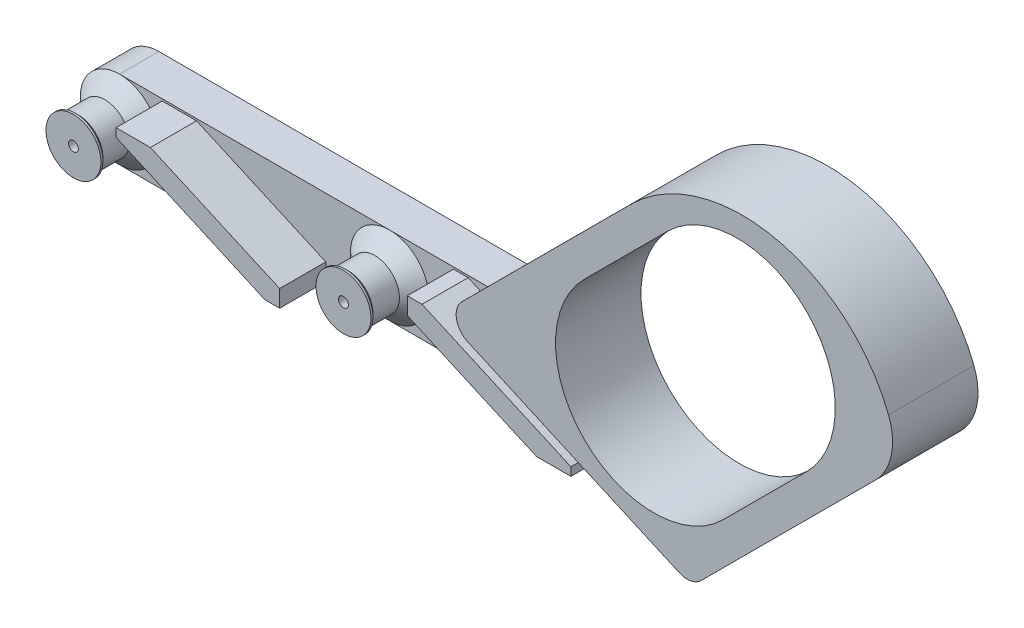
ISO-10303-21;
HEADER;
FILE_DESCRIPTION(('STEP AP214'),'2;1');
FILE_NAME('part.step','',(''),(''),'','','');
FILE_SCHEMA(('AUTOMOTIVE_DESIGN { 1 0 10303 214 1 1 1 1 }'));
ENDSEC;
DATA;
#1=APPLICATION_CONTEXT('core data for automotive mechanical design processes');
#2=APPLICATION_PROTOCOL_DEFINITION('international standard','automotive_design',2000,#1);
#3=PRODUCT_CONTEXT('',#1,'mechanical');
#4=PRODUCT('Part','Part','',(#3));
#5=PRODUCT_RELATED_PRODUCT_CATEGORY('part','',(#4));
#6=PRODUCT_DEFINITION_FORMATION('','',#4);
#7=PRODUCT_DEFINITION_CONTEXT('part definition',#1,'design');
#8=PRODUCT_DEFINITION('design','',#6,#7);
#9=PRODUCT_DEFINITION_SHAPE('','',#8);
#10=(LENGTH_UNIT() NAMED_UNIT(*) SI_UNIT(.MILLI.,.METRE.));
#11=(NAMED_UNIT(*) PLANE_ANGLE_UNIT() SI_UNIT($,.RADIAN.));
#12=(NAMED_UNIT(*) SI_UNIT($,.STERADIAN.) SOLID_ANGLE_UNIT());
#13=UNCERTAINTY_MEASURE_WITH_UNIT(LENGTH_MEASURE(1.E-05),#10,'distance_accuracy_value','');
#14=(GEOMETRIC_REPRESENTATION_CONTEXT(3) GLOBAL_UNCERTAINTY_ASSIGNED_CONTEXT((#13)) GLOBAL_UNIT_ASSIGNED_CONTEXT((#10,
#11,#12)) REPRESENTATION_CONTEXT('',''));
#15=CARTESIAN_POINT('',(0.,0.,0.));
#16=DIRECTION('',(0.,0.,1.));
#17=DIRECTION('',(1.,0.,0.));
#18=AXIS2_PLACEMENT_3D('',#15,#16,#17);
#19=CARTESIAN_POINT('',(27.5,0.,4.));
#20=DIRECTION('',(0.,0.,-1.));
#21=DIRECTION('',(-1.,0.,0.));
#22=AXIS2_PLACEMENT_3D('',#19,#20,#21);
#23=CYLINDRICAL_SURFACE('',#22,4.00000000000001);
#24=DIRECTION('',(0.,0.,-1.));
#25=VECTOR('',#24,1.);
#26=CARTESIAN_POINT('',(27.9133310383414,-3.97858736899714,4.));
#27=LINE('',#26,#25);
#28=CARTESIAN_POINT('',(27.9133310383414,-3.97858736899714,4.));
#29=VERTEX_POINT('',#28);
#30=CARTESIAN_POINT('',(27.9133310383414,-3.97858736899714,0.));
#31=VERTEX_POINT('',#30);
#32=EDGE_CURVE('E242',#29,#31,#27,.T.);
#33=ORIENTED_EDGE('',*,*,#32,.F.);
#34=CARTESIAN_POINT('',(27.5,0.,3.99999999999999));
#35=DIRECTION('',(0.,0.,1.));
#36=DIRECTION('',(1.,0.,0.));
#37=AXIS2_PLACEMENT_3D('',#34,#35,#36);
#38=CIRCLE('',#37,4.00000000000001);
#39=CARTESIAN_POINT('',(27.5,-4.,4.));
#40=VERTEX_POINT('',#39);
#41=EDGE_CURVE('E252',#29,#40,#38,.F.);
#42=ORIENTED_EDGE('',*,*,#41,.T.);
#43=DIRECTION('',(0.,0.,-1.));
#44=VECTOR('',#43,1.);
#45=CARTESIAN_POINT('',(27.5,-4.00000000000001,4.));
#46=LINE('',#45,#44);
#47=CARTESIAN_POINT('',(27.5,-4.00000000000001,0.));
#48=VERTEX_POINT('',#47);
#49=EDGE_CURVE('E427',#40,#48,#46,.T.);
#50=ORIENTED_EDGE('',*,*,#49,.T.);
#51=CARTESIAN_POINT('',(27.5,0.,0.));
#52=DIRECTION('',(0.,0.,1.));
#53=DIRECTION('',(1.,0.,0.));
#54=AXIS2_PLACEMENT_3D('',#51,#52,#53);
#55=CIRCLE('',#54,4.00000000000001);
#56=EDGE_CURVE('E265',#48,#31,#55,.T.);
#57=ORIENTED_EDGE('',*,*,#56,.T.);
#58=EDGE_LOOP('',(#33,#42,#50,#57));
#59=FACE_BOUND('',#58,.T.);
#60=ADVANCED_FACE('F45',(#59),#23,.T.);
#61=CARTESIAN_POINT('',(-27.5,4.,4.));
#62=DIRECTION('',(0.,-1.,0.));
#63=DIRECTION('',(1.,0.,0.));
#64=AXIS2_PLACEMENT_3D('',#61,#62,#63);
#65=PLANE('',#64);
#66=DIRECTION('',(0.,0.,-1.));
#67=VECTOR('',#66,1.);
#68=CARTESIAN_POINT('',(11.5780184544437,4.00000000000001,65.2222167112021));
#69=LINE('',#68,#67);
#70=CARTESIAN_POINT('',(11.5780184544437,4.00000000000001,0.));
#71=VERTEX_POINT('',#70);
#72=CARTESIAN_POINT('',(11.5780184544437,4.00000000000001,4.));
#73=VERTEX_POINT('',#72);
#74=EDGE_CURVE('E268',#71,#73,#69,.F.);
#75=ORIENTED_EDGE('',*,*,#74,.F.);
#76=DIRECTION('',(-1.,0.,0.));
#77=VECTOR('',#76,1.);
#78=CARTESIAN_POINT('',(-27.5,4.,0.));
#79=LINE('',#78,#77);
#80=CARTESIAN_POINT('',(-27.5,4.,0.));
#81=VERTEX_POINT('',#80);
#82=EDGE_CURVE('E423',#71,#81,#79,.T.);
#83=ORIENTED_EDGE('',*,*,#82,.T.);
#84=DIRECTION('',(0.,0.,-1.));
#85=VECTOR('',#84,1.);
#86=CARTESIAN_POINT('',(-27.5,4.,4.));
#87=LINE('',#86,#85);
#88=CARTESIAN_POINT('',(-27.5,4.,4.));
#89=VERTEX_POINT('',#88);
#90=EDGE_CURVE('E418',#89,#81,#87,.T.);
#91=ORIENTED_EDGE('',*,*,#90,.F.);
#92=DIRECTION('',(-1.,0.,0.));
#93=VECTOR('',#92,1.);
#94=CARTESIAN_POINT('',(-27.5,4.,4.));
#95=LINE('',#94,#93);
#96=CARTESIAN_POINT('',(0.,4.,4.));
#97=VERTEX_POINT('',#96);
#98=EDGE_CURVE('E415',#97,#89,#95,.T.);
#99=ORIENTED_EDGE('',*,*,#98,.F.);
#100=EDGE_CURVE('E416',#73,#97,#95,.T.);
#101=ORIENTED_EDGE('',*,*,#100,.F.);
#102=EDGE_LOOP('',(#75,#83,#91,#99,#101));
#103=FACE_BOUND('',#102,.T.);
#104=ADVANCED_FACE('F475',(#103),#65,.F.);
#105=CARTESIAN_POINT('',(-27.5,0.,4.));
#106=DIRECTION('',(0.,0.,1.));
#107=DIRECTION('',(1.,0.,0.));
#108=AXIS2_PLACEMENT_3D('',#105,#106,#107);
#109=PLANE('',#108);
#110=DIRECTION('',(1.,0.,0.));
#111=VECTOR('',#110,1.);
#112=CARTESIAN_POINT('',(-27.5,-4.,4.));
#113=LINE('',#112,#111);
#114=CARTESIAN_POINT('',(0.,-4.,4.));
#115=VERTEX_POINT('',#114);
#116=EDGE_CURVE('E257',#115,#40,#113,.T.);
#117=ORIENTED_EDGE('',*,*,#116,.T.);
#118=ORIENTED_EDGE('',*,*,#41,.F.);
#119=DIRECTION('',(-0.913545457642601,0.406736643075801,0.));
#120=VECTOR('',#119,1.);
#121=CARTESIAN_POINT('',(-19.811045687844,17.2696741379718,4.));
#122=LINE('',#121,#120);
#123=CARTESIAN_POINT('',(12.6593802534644,2.8129090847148,4.));
#124=VERTEX_POINT('',#123);
#125=EDGE_CURVE('E236',#29,#124,#122,.T.);
#126=ORIENTED_EDGE('',*,*,#125,.T.);
#127=CARTESIAN_POINT('',(13.472853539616,4.64,4.));
#128=DIRECTION('',(0.,0.,1.));
#129=DIRECTION('',(1.,0.,0.));
#130=AXIS2_PLACEMENT_3D('',#127,#128,#129);
#131=CIRCLE('',#130,2.);
#132=EDGE_CURVE('E266',#124,#73,#131,.F.);
#133=ORIENTED_EDGE('',*,*,#132,.T.);
#134=ORIENTED_EDGE('',*,*,#100,.T.);
#135=CARTESIAN_POINT('',(0.,0.,4.));
#136=DIRECTION('',(0.,0.,-1.));
#137=DIRECTION('',(-1.,0.,0.));
#138=AXIS2_PLACEMENT_3D('',#135,#136,#137);
#139=CIRCLE('',#138,4.);
#140=EDGE_CURVE('E402',#97,#115,#139,.T.);
#141=ORIENTED_EDGE('',*,*,#140,.T.);
#142=EDGE_LOOP('',(#117,#118,#126,#133,#134,#141));
#143=FACE_BOUND('',#142,.T.);
#144=DIRECTION('',(1.,0.,0.));
#145=VECTOR('',#144,1.);
#146=CARTESIAN_POINT('',(19.6609741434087,-3.8,4.));
#147=LINE('',#146,#145);
#148=CARTESIAN_POINT('',(19.6609741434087,-3.8,4.));
#149=VERTEX_POINT('',#148);
#150=CARTESIAN_POINT('',(23.1609741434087,-3.8,4.));
#151=VERTEX_POINT('',#150);
#152=EDGE_CURVE('E301',#149,#151,#147,.T.);
#153=ORIENTED_EDGE('',*,*,#152,.F.);
#154=DIRECTION('',(0.9135454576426,-0.406736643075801,0.));
#155=VECTOR('',#154,1.);
#156=CARTESIAN_POINT('',(6.5,2.0596432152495,4.));
#157=LINE('',#156,#155);
#158=CARTESIAN_POINT('',(6.5,2.0596432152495,4.));
#159=VERTEX_POINT('',#158);
#160=EDGE_CURVE('E305',#159,#149,#157,.T.);
#161=ORIENTED_EDGE('',*,*,#160,.F.);
#162=DIRECTION('',(0.,-1.,0.));
#163=VECTOR('',#162,1.);
#164=CARTESIAN_POINT('',(6.5,3.8,4.));
#165=LINE('',#164,#163);
#166=CARTESIAN_POINT('',(6.5,3.8,4.));
#167=VERTEX_POINT('',#166);
#168=EDGE_CURVE('E308',#167,#159,#165,.T.);
#169=ORIENTED_EDGE('',*,*,#168,.F.);
#170=DIRECTION('',(-1.,0.,0.));
#171=VECTOR('',#170,1.);
#172=CARTESIAN_POINT('',(8.,3.8,4.));
#173=LINE('',#172,#171);
#174=CARTESIAN_POINT('',(8.,3.8,4.));
#175=VERTEX_POINT('',#174);
#176=EDGE_CURVE('E312',#175,#167,#173,.T.);
#177=ORIENTED_EDGE('',*,*,#176,.F.);
#178=DIRECTION('',(-0.9135454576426,0.406736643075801,0.));
#179=VECTOR('',#178,1.);
#180=CARTESIAN_POINT('',(23.1609741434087,-2.95010058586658,4.));
#181=LINE('',#180,#179);
#182=CARTESIAN_POINT('',(23.1609741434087,-2.95010058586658,4.));
#183=VERTEX_POINT('',#182);
#184=EDGE_CURVE('E293',#183,#175,#181,.T.);
#185=ORIENTED_EDGE('',*,*,#184,.F.);
#186=DIRECTION('',(0.,1.,0.));
#187=VECTOR('',#186,1.);
#188=CARTESIAN_POINT('',(23.1609741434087,-3.8,4.));
#189=LINE('',#188,#187);
#190=EDGE_CURVE('E297',#151,#183,#189,.T.);
#191=ORIENTED_EDGE('',*,*,#190,.F.);
#192=EDGE_LOOP('',(#153,#161,#169,#177,#185,#191));
#193=FACE_BOUND('',#192,.T.);
#194=ADVANCED_FACE('F253',(#143,#193),#109,.T.);
#195=DIRECTION('',(1.,0.,0.));
#196=VECTOR('',#195,1.);
#197=CARTESIAN_POINT('',(-8.,-3.8,4.));
#198=LINE('',#197,#196);
#199=CARTESIAN_POINT('',(-8.,-3.8,4.));
#200=VERTEX_POINT('',#199);
#201=CARTESIAN_POINT('',(-6.5,-3.8,4.));
#202=VERTEX_POINT('',#201);
#203=EDGE_CURVE('E361',#200,#202,#198,.T.);
#204=ORIENTED_EDGE('',*,*,#203,.F.);
#205=DIRECTION('',(0.9135454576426,-0.406736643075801,0.));
#206=VECTOR('',#205,1.);
#207=CARTESIAN_POINT('',(-23.1609741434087,2.95010058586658,4.));
#208=LINE('',#207,#206);
#209=CARTESIAN_POINT('',(-23.1609741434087,2.95010058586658,4.));
#210=VERTEX_POINT('',#209);
#211=EDGE_CURVE('E343',#210,#200,#208,.T.);
#212=ORIENTED_EDGE('',*,*,#211,.F.);
#213=DIRECTION('',(0.,-1.,0.));
#214=VECTOR('',#213,1.);
#215=CARTESIAN_POINT('',(-23.1609741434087,3.8,4.));
#216=LINE('',#215,#214);
#217=CARTESIAN_POINT('',(-23.1609741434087,3.8,4.));
#218=VERTEX_POINT('',#217);
#219=EDGE_CURVE('E347',#218,#210,#216,.T.);
#220=ORIENTED_EDGE('',*,*,#219,.F.);
#221=DIRECTION('',(-1.,0.,0.));
#222=VECTOR('',#221,1.);
#223=CARTESIAN_POINT('',(-19.6609741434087,3.8,4.));
#224=LINE('',#223,#222);
#225=CARTESIAN_POINT('',(-19.6609741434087,3.8,4.));
#226=VERTEX_POINT('',#225);
#227=EDGE_CURVE('E350',#226,#218,#224,.T.);
#228=ORIENTED_EDGE('',*,*,#227,.F.);
#229=DIRECTION('',(-0.9135454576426,0.406736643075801,0.));
#230=VECTOR('',#229,1.);
#231=CARTESIAN_POINT('',(-6.5,-2.0596432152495,4.));
#232=LINE('',#231,#230);
#233=CARTESIAN_POINT('',(-6.5,-2.0596432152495,4.));
#234=VERTEX_POINT('',#233);
#235=EDGE_CURVE('E354',#234,#226,#232,.T.);
#236=ORIENTED_EDGE('',*,*,#235,.F.);
#237=DIRECTION('',(0.,1.,0.));
#238=VECTOR('',#237,1.);
#239=CARTESIAN_POINT('',(-6.5,-3.8,4.));
#240=LINE('',#239,#238);
#241=EDGE_CURVE('E357',#202,#234,#240,.T.);
#242=ORIENTED_EDGE('',*,*,#241,.F.);
#243=EDGE_LOOP('',(#204,#212,#220,#228,#236,#242));
#244=FACE_BOUND('',#243,.T.);
#245=CARTESIAN_POINT('',(-27.5,-4.,4.));
#246=VERTEX_POINT('',#245);
#247=EDGE_CURVE('E413',#246,#115,#113,.T.);
#248=ORIENTED_EDGE('',*,*,#247,.T.);
#249=CARTESIAN_POINT('',(0.,0.,4.));
#250=DIRECTION('',(0.,0.,1.));
#251=DIRECTION('',(1.,0.,0.));
#252=AXIS2_PLACEMENT_3D('',#249,#250,#251);
#253=CIRCLE('',#252,4.);
#254=EDGE_CURVE('E261',#97,#115,#253,.T.);
#255=ORIENTED_EDGE('',*,*,#254,.F.);
#256=ORIENTED_EDGE('',*,*,#98,.T.);
#257=CARTESIAN_POINT('',(-27.5,0.,4.));
#258=DIRECTION('',(0.,0.,1.));
#259=DIRECTION('',(1.,0.,0.));
#260=AXIS2_PLACEMENT_3D('',#257,#258,#259);
#261=CIRCLE('',#260,4.);
#262=EDGE_CURVE('E408',#246,#89,#261,.T.);
#263=ORIENTED_EDGE('',*,*,#262,.F.);
#264=EDGE_LOOP('',(#248,#255,#256,#263));
#265=FACE_BOUND('',#264,.T.);
#266=ADVANCED_FACE('F494',(#244,#265),#109,.T.);
#267=CARTESIAN_POINT('',(-27.5,0.,4.));
#268=DIRECTION('',(0.,0.,-1.));
#269=DIRECTION('',(-1.,0.,0.));
#270=AXIS2_PLACEMENT_3D('',#267,#268,#269);
#271=CYLINDRICAL_SURFACE('',#270,4.);
#272=DIRECTION('',(0.,0.,-1.));
#273=VECTOR('',#272,1.);
#274=CARTESIAN_POINT('',(-27.5,-4.,4.));
#275=LINE('',#274,#273);
#276=CARTESIAN_POINT('',(-27.5,-4.,0.));
#277=VERTEX_POINT('',#276);
#278=EDGE_CURVE('E412',#246,#277,#275,.T.);
#279=ORIENTED_EDGE('',*,*,#278,.F.);
#280=CARTESIAN_POINT('',(-27.5,0.,4.00000000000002));
#281=DIRECTION('',(0.,0.,1.));
#282=DIRECTION('',(1.,0.,0.));
#283=AXIS2_PLACEMENT_3D('',#280,#281,#282);
#284=CIRCLE('',#283,4.);
#285=EDGE_CURVE('E433',#246,#89,#284,.F.);
#286=ORIENTED_EDGE('',*,*,#285,.T.);
#287=ORIENTED_EDGE('',*,*,#90,.T.);
#288=CARTESIAN_POINT('',(-27.5,0.,0.));
#289=DIRECTION('',(0.,0.,1.));
#290=DIRECTION('',(1.,0.,0.));
#291=AXIS2_PLACEMENT_3D('',#288,#289,#290);
#292=CIRCLE('',#291,4.);
#293=EDGE_CURVE('E407',#81,#277,#292,.T.);
#294=ORIENTED_EDGE('',*,*,#293,.T.);
#295=EDGE_LOOP('',(#279,#286,#287,#294));
#296=FACE_BOUND('',#295,.T.);
#297=ADVANCED_FACE('F490',(#296),#271,.T.);
#298=CARTESIAN_POINT('',(-27.5,-4.,4.));
#299=DIRECTION('',(0.,1.,0.));
#300=DIRECTION('',(0.,0.,1.));
#301=AXIS2_PLACEMENT_3D('',#298,#299,#300);
#302=PLANE('',#301);
#303=DIRECTION('',(1.,0.,0.));
#304=VECTOR('',#303,1.);
#305=CARTESIAN_POINT('',(-27.5,-4.,0.));
#306=LINE('',#305,#304);
#307=EDGE_CURVE('E420',#277,#48,#306,.T.);
#308=ORIENTED_EDGE('',*,*,#307,.T.);
#309=ORIENTED_EDGE('',*,*,#49,.F.);
#310=ORIENTED_EDGE('',*,*,#116,.F.);
#311=ORIENTED_EDGE('',*,*,#247,.F.);
#312=ORIENTED_EDGE('',*,*,#278,.T.);
#313=EDGE_LOOP('',(#308,#309,#310,#311,#312));
#314=FACE_BOUND('',#313,.T.);
#315=ADVANCED_FACE('F486',(#314),#302,.F.);
#316=CARTESIAN_POINT('',(-27.5,0.,0.));
#317=DIRECTION('',(0.,0.,1.));
#318=DIRECTION('',(1.,0.,0.));
#319=AXIS2_PLACEMENT_3D('',#316,#317,#318);
#320=PLANE('',#319);
#321=ORIENTED_EDGE('',*,*,#82,.F.);
#322=CARTESIAN_POINT('',(13.472853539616,4.64,0.));
#323=DIRECTION('',(0.,0.,1.));
#324=DIRECTION('',(1.,0.,0.));
#325=AXIS2_PLACEMENT_3D('',#322,#323,#324);
#326=CIRCLE('',#325,2.);
#327=CARTESIAN_POINT('',(12.0591099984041,6.05468342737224,0.));
#328=VERTEX_POINT('',#327);
#329=EDGE_CURVE('E549',#71,#328,#326,.F.);
#330=ORIENTED_EDGE('',*,*,#329,.T.);
#331=DIRECTION('',(0.707341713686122,0.706871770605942,0.));
#332=VECTOR('',#331,1.);
#333=CARTESIAN_POINT('',(29.3018035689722,23.2859213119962,0.));
#334=LINE('',#333,#332);
#335=CARTESIAN_POINT('',(29.3018035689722,23.2859213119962,0.));
#336=VERTEX_POINT('',#335);
#337=EDGE_CURVE('E551',#328,#336,#334,.T.);
#338=ORIENTED_EDGE('',*,*,#337,.T.);
#339=CARTESIAN_POINT('',(40.6117518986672,11.9684538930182,0.));
#340=DIRECTION('',(0.,0.,1.));
#341=DIRECTION('',(1.,0.,0.));
#342=AXIS2_PLACEMENT_3D('',#339,#340,#341);
#343=CIRCLE('',#342,16.);
#344=CARTESIAN_POINT('',(55.5083614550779,17.8072057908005,0.));
#345=VERTEX_POINT('',#344);
#346=EDGE_CURVE('E607',#336,#345,#343,.F.);
#347=ORIENTED_EDGE('',*,*,#346,.T.);
#348=CARTESIAN_POINT('',(49.9221328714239,15.6176738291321,0.));
#349=DIRECTION('',(0.,0.,1.));
#350=DIRECTION('',(1.,0.,0.));
#351=AXIS2_PLACEMENT_3D('',#348,#349,#350);
#352=CIRCLE('',#351,6.);
#353=CARTESIAN_POINT('',(54.1633634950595,11.3736235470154,0.));
#354=VERTEX_POINT('',#353);
#355=EDGE_CURVE('E61',#345,#354,#352,.F.);
#356=ORIENTED_EDGE('',*,*,#355,.T.);
#357=DIRECTION('',(-0.707341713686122,-0.706871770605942,0.));
#358=VECTOR('',#357,1.);
#359=CARTESIAN_POINT('',(54.1633634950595,11.3736235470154,0.));
#360=LINE('',#359,#358);
#361=CARTESIAN_POINT('',(36.4172168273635,-6.36073295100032,0.));
#362=VERTEX_POINT('',#361);
#363=EDGE_CURVE('E553',#354,#362,#360,.T.);
#364=ORIENTED_EDGE('',*,*,#363,.T.);
#365=CARTESIAN_POINT('',(35.0034732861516,-4.94604952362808,0.));
#366=DIRECTION('',(0.,0.,1.));
#367=DIRECTION('',(1.,0.,0.));
#368=AXIS2_PLACEMENT_3D('',#365,#366,#367);
#369=CIRCLE('',#368,2.);
#370=CARTESIAN_POINT('',(34.19,-6.77314043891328,0.));
#371=VERTEX_POINT('',#370);
#372=EDGE_CURVE('E547',#362,#371,#369,.F.);
#373=ORIENTED_EDGE('',*,*,#372,.T.);
#374=DIRECTION('',(-0.913545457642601,0.406736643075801,0.));
#375=VECTOR('',#374,1.);
#376=CARTESIAN_POINT('',(34.19,-6.77314043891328,0.));
#377=LINE('',#376,#375);
#378=EDGE_CURVE('E545',#371,#31,#377,.T.);
#379=ORIENTED_EDGE('',*,*,#378,.T.);
#380=ORIENTED_EDGE('',*,*,#56,.F.);
#381=ORIENTED_EDGE('',*,*,#307,.F.);
#382=ORIENTED_EDGE('',*,*,#293,.F.);
#383=EDGE_LOOP('',(#321,#330,#338,#347,#356,#364,#373,#379,#380,#381,#382));
#384=FACE_BOUND('',#383,.T.);
#385=CARTESIAN_POINT('',(0.,0.,0.));
#386=DIRECTION('',(0.,0.,-1.));
#387=DIRECTION('',(-1.,0.,0.));
#388=AXIS2_PLACEMENT_3D('',#385,#386,#387);
#389=CIRCLE('',#388,0.5);
#390=CARTESIAN_POINT('',(-0.5,0.,0.));
#391=VERTEX_POINT('',#390);
#392=EDGE_CURVE('E389',#391,#391,#389,.T.);
#393=ORIENTED_EDGE('',*,*,#392,.F.);
#394=EDGE_LOOP('',(#393));
#395=FACE_BOUND('',#394,.T.);
#396=CARTESIAN_POINT('',(-27.5,0.,0.));
#397=DIRECTION('',(0.,0.,-1.));
#398=DIRECTION('',(-1.,0.,0.));
#399=AXIS2_PLACEMENT_3D('',#396,#397,#398);
#400=CIRCLE('',#399,0.499999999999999);
#401=CARTESIAN_POINT('',(-28.,0.,0.));
#402=VERTEX_POINT('',#401);
#403=EDGE_CURVE('E367',#402,#402,#400,.T.);
#404=ORIENTED_EDGE('',*,*,#403,.F.);
#405=EDGE_LOOP('',(#404));
#406=FACE_BOUND('',#405,.T.);
#407=DIRECTION('',(-0.707341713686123,-0.706871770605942,0.));
#408=VECTOR('',#407,1.);
#409=CARTESIAN_POINT('',(24.5304681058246,14.2765242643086,0.));
#410=LINE('',#409,#408);
#411=CARTESIAN_POINT('',(33.0185686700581,22.7589855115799,0.));
#412=VERTEX_POINT('',#411);
#413=CARTESIAN_POINT('',(24.5304681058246,14.2765242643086,0.));
#414=VERTEX_POINT('',#413);
#415=EDGE_CURVE('E559',#412,#414,#410,.T.);
#416=ORIENTED_EDGE('',*,*,#415,.T.);
#417=CARTESIAN_POINT('',(31.599185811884,7.20310712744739,0.));
#418=DIRECTION('',(0.,0.,1.));
#419=DIRECTION('',(1.,0.,0.));
#420=AXIS2_PLACEMENT_3D('',#417,#418,#419);
#421=CIRCLE('',#420,10.);
#422=CARTESIAN_POINT('',(38.6679035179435,0.12968999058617,0.));
#423=VERTEX_POINT('',#422);
#424=EDGE_CURVE('E68',#414,#423,#421,.T.);
#425=ORIENTED_EDGE('',*,*,#424,.T.);
#426=DIRECTION('',(0.707341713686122,0.706871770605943,0.));
#427=VECTOR('',#426,1.);
#428=CARTESIAN_POINT('',(38.6679035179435,0.12968999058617,0.));
#429=LINE('',#428,#427);
#430=CARTESIAN_POINT('',(47.1560040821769,8.61215123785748,0.));
#431=VERTEX_POINT('',#430);
#432=EDGE_CURVE('E11',#423,#431,#429,.T.);
#433=ORIENTED_EDGE('',*,*,#432,.T.);
#434=CARTESIAN_POINT('',(40.0872863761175,15.6855683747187,0.));
#435=DIRECTION('',(0.,0.,1.));
#436=DIRECTION('',(1.,0.,0.));
#437=AXIS2_PLACEMENT_3D('',#434,#435,#436);
#438=CIRCLE('',#437,9.99999999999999);
#439=EDGE_CURVE('E557',#431,#412,#438,.T.);
#440=ORIENTED_EDGE('',*,*,#439,.T.);
#441=EDGE_LOOP('',(#416,#425,#433,#440));
#442=FACE_BOUND('',#441,.T.);
#443=ADVANCED_FACE('F489',(#384,#395,#406,#442),#320,.F.);
#444=CARTESIAN_POINT('',(-27.5,0.,5.5));
#445=DIRECTION('',(0.,0.,-1.));
#446=DIRECTION('',(-1.,0.,0.));
#447=AXIS2_PLACEMENT_3D('',#444,#445,#446);
#448=CONICAL_SURFACE('',#447,2.50000000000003,0.785398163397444);
#449=ORIENTED_EDGE('',*,*,#262,.T.);
#450=ORIENTED_EDGE('',*,*,#285,.F.);
#451=EDGE_LOOP('',(#449,#450));
#452=FACE_BOUND('',#451,.T.);
#453=CARTESIAN_POINT('',(-27.5,0.,5.5));
#454=DIRECTION('',(0.,0.,1.));
#455=DIRECTION('',(1.,0.,0.));
#456=AXIS2_PLACEMENT_3D('',#453,#454,#455);
#457=CIRCLE('',#456,2.50000000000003);
#458=CARTESIAN_POINT('',(-25.,0.,5.5));
#459=VERTEX_POINT('',#458);
#460=EDGE_CURVE('E411',#459,#459,#457,.T.);
#461=ORIENTED_EDGE('',*,*,#460,.F.);
#462=EDGE_LOOP('',(#461));
#463=FACE_BOUND('',#462,.T.);
#464=ADVANCED_FACE('F471',(#452,#463),#448,.T.);
#465=CARTESIAN_POINT('',(-27.5,0.,7.5));
#466=DIRECTION('',(0.,0.,-1.));
#467=DIRECTION('',(-1.,0.,0.));
#468=AXIS2_PLACEMENT_3D('',#465,#466,#467);
#469=CYLINDRICAL_SURFACE('',#468,2.50000000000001);
#470=CARTESIAN_POINT('',(-27.5,0.,8.20000000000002));
#471=DIRECTION('',(0.,0.,1.));
#472=DIRECTION('',(1.,0.,0.));
#473=AXIS2_PLACEMENT_3D('',#470,#471,#472);
#474=CIRCLE('',#473,2.50000000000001);
#475=CARTESIAN_POINT('',(-25.,0.,8.20000000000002));
#476=VERTEX_POINT('',#475);
#477=EDGE_CURVE('E262',#476,#476,#474,.F.);
#478=ORIENTED_EDGE('',*,*,#477,.T.);
#479=EDGE_LOOP('',(#478));
#480=FACE_BOUND('',#479,.T.);
#481=ORIENTED_EDGE('',*,*,#460,.T.);
#482=EDGE_LOOP('',(#481));
#483=FACE_BOUND('',#482,.T.);
#484=ADVANCED_FACE('F464',(#480,#483),#469,.T.);
#485=CARTESIAN_POINT('',(-27.5,0.,8.7));
#486=DIRECTION('',(0.,0.,-1.));
#487=DIRECTION('',(-1.,0.,0.));
#488=AXIS2_PLACEMENT_3D('',#485,#486,#487);
#489=CYLINDRICAL_SURFACE('',#488,2.8);
#490=CARTESIAN_POINT('',(-27.5,0.,8.50000000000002));
#491=DIRECTION('',(0.,0.,1.));
#492=DIRECTION('',(1.,0.,0.));
#493=AXIS2_PLACEMENT_3D('',#490,#491,#492);
#494=CIRCLE('',#493,2.8);
#495=CARTESIAN_POINT('',(-24.7,0.,8.50000000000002));
#496=VERTEX_POINT('',#495);
#497=EDGE_CURVE('E436',#496,#496,#494,.T.);
#498=ORIENTED_EDGE('',*,*,#497,.T.);
#499=EDGE_LOOP('',(#498));
#500=FACE_BOUND('',#499,.T.);
#501=CARTESIAN_POINT('',(-27.5,0.,8.7));
#502=DIRECTION('',(0.,0.,1.));
#503=DIRECTION('',(1.,0.,0.));
#504=AXIS2_PLACEMENT_3D('',#501,#502,#503);
#505=CIRCLE('',#504,2.8);
#506=CARTESIAN_POINT('',(-24.7,0.,8.7));
#507=VERTEX_POINT('',#506);
#508=EDGE_CURVE('E404',#507,#507,#505,.T.);
#509=ORIENTED_EDGE('',*,*,#508,.F.);
#510=EDGE_LOOP('',(#509));
#511=FACE_BOUND('',#510,.T.);
#512=ADVANCED_FACE('F459',(#500,#511),#489,.T.);
#513=CARTESIAN_POINT('',(-27.5,0.,8.7));
#514=DIRECTION('',(0.,0.,1.));
#515=DIRECTION('',(1.,0.,0.));
#516=AXIS2_PLACEMENT_3D('',#513,#514,#515);
#517=PLANE('',#516);
#518=CARTESIAN_POINT('',(-27.5,0.,8.7));
#519=DIRECTION('',(0.,0.,1.));
#520=DIRECTION('',(1.,0.,0.));
#521=AXIS2_PLACEMENT_3D('',#518,#519,#520);
#522=CIRCLE('',#521,0.499999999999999);
#523=CARTESIAN_POINT('',(-27.,0.,8.7));
#524=VERTEX_POINT('',#523);
#525=EDGE_CURVE('E399',#524,#524,#522,.T.);
#526=ORIENTED_EDGE('',*,*,#525,.F.);
#527=EDGE_LOOP('',(#526));
#528=FACE_BOUND('',#527,.T.);
#529=ORIENTED_EDGE('',*,*,#508,.T.);
#530=EDGE_LOOP('',(#529));
#531=FACE_BOUND('',#530,.T.);
#532=ADVANCED_FACE('F455',(#528,#531),#517,.T.);
#533=CARTESIAN_POINT('',(-27.5,0.,8.50000000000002));
#534=DIRECTION('',(0.,0.,1.));
#535=DIRECTION('',(1.,0.,0.));
#536=AXIS2_PLACEMENT_3D('',#533,#534,#535);
#537=CONICAL_SURFACE('',#536,2.8,0.785398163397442);
#538=ORIENTED_EDGE('',*,*,#477,.F.);
#539=EDGE_LOOP('',(#538));
#540=FACE_BOUND('',#539,.T.);
#541=ORIENTED_EDGE('',*,*,#497,.F.);
#542=EDGE_LOOP('',(#541));
#543=FACE_BOUND('',#542,.T.);
#544=ADVANCED_FACE('F458',(#540,#543),#537,.T.);
#545=CARTESIAN_POINT('',(27.5,0.,8.7));
#546=DIRECTION('',(0.,0.,1.));
#547=DIRECTION('',(-1.,0.,0.));
#548=AXIS2_PLACEMENT_3D('',#545,#546,#547);
#549=PLANE('',#548);
#550=DIRECTION('',(0.707341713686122,0.706871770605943,0.));
#551=VECTOR('',#550,1.);
#552=CARTESIAN_POINT('',(38.6679035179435,0.129689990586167,8.7));
#553=LINE('',#552,#551);
#554=CARTESIAN_POINT('',(38.6679035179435,0.129689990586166,8.7));
#555=VERTEX_POINT('',#554);
#556=CARTESIAN_POINT('',(47.1560040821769,8.61215123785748,8.7));
#557=VERTEX_POINT('',#556);
#558=EDGE_CURVE('E565',#555,#557,#553,.T.);
#559=ORIENTED_EDGE('',*,*,#558,.F.);
#560=CARTESIAN_POINT('',(31.599185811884,7.20310712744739,8.7));
#561=DIRECTION('',(0.,0.,1.));
#562=DIRECTION('',(1.,0.,0.));
#563=AXIS2_PLACEMENT_3D('',#560,#561,#562);
#564=CIRCLE('',#563,10.);
#565=CARTESIAN_POINT('',(24.5304681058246,14.2765242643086,8.7));
#566=VERTEX_POINT('',#565);
#567=EDGE_CURVE('E568',#566,#555,#564,.T.);
#568=ORIENTED_EDGE('',*,*,#567,.F.);
#569=DIRECTION('',(-0.707341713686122,-0.706871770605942,0.));
#570=VECTOR('',#569,1.);
#571=CARTESIAN_POINT('',(24.5304681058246,14.2765242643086,8.7));
#572=LINE('',#571,#570);
#573=CARTESIAN_POINT('',(33.0185686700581,22.7589855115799,8.7));
#574=VERTEX_POINT('',#573);
#575=EDGE_CURVE('E591',#574,#566,#572,.T.);
#576=ORIENTED_EDGE('',*,*,#575,.F.);
#577=CARTESIAN_POINT('',(40.0872863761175,15.6855683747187,8.7));
#578=DIRECTION('',(0.,0.,1.));
#579=DIRECTION('',(1.,0.,0.));
#580=AXIS2_PLACEMENT_3D('',#577,#578,#579);
#581=CIRCLE('',#580,9.99999999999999);
#582=EDGE_CURVE('E562',#557,#574,#581,.T.);
#583=ORIENTED_EDGE('',*,*,#582,.F.);
#584=EDGE_LOOP('',(#559,#568,#576,#583));
#585=FACE_BOUND('',#584,.T.);
#586=DIRECTION('',(0.707341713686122,0.706871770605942,0.));
#587=VECTOR('',#586,1.);
#588=CARTESIAN_POINT('',(36.4172168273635,-6.36073295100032,8.7));
#589=LINE('',#588,#587);
#590=CARTESIAN_POINT('',(36.4172168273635,-6.36073295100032,8.7));
#591=VERTEX_POINT('',#590);
#592=CARTESIAN_POINT('',(54.1633634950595,11.3736235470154,8.7));
#593=VERTEX_POINT('',#592);
#594=EDGE_CURVE('E570',#591,#593,#589,.T.);
#595=ORIENTED_EDGE('',*,*,#594,.T.);
#596=CARTESIAN_POINT('',(49.9221328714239,15.6176738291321,8.7));
#597=DIRECTION('',(0.,0.,1.));
#598=DIRECTION('',(1.,0.,0.));
#599=AXIS2_PLACEMENT_3D('',#596,#597,#598);
#600=CIRCLE('',#599,6.);
#601=CARTESIAN_POINT('',(55.5083614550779,17.8072057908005,8.7));
#602=VERTEX_POINT('',#601);
#603=EDGE_CURVE('E587',#593,#602,#600,.T.);
#604=ORIENTED_EDGE('',*,*,#603,.T.);
#605=CARTESIAN_POINT('',(40.6117518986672,11.9684538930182,8.7));
#606=DIRECTION('',(0.,0.,1.));
#607=DIRECTION('',(1.,0.,0.));
#608=AXIS2_PLACEMENT_3D('',#605,#606,#607);
#609=CIRCLE('',#608,16.);
#610=CARTESIAN_POINT('',(29.3018035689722,23.2859213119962,8.7));
#611=VERTEX_POINT('',#610);
#612=EDGE_CURVE('E584',#602,#611,#609,.T.);
#613=ORIENTED_EDGE('',*,*,#612,.T.);
#614=DIRECTION('',(-0.707341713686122,-0.706871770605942,0.));
#615=VECTOR('',#614,1.);
#616=CARTESIAN_POINT('',(12.0591099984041,6.05468342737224,8.7));
#617=LINE('',#616,#615);
#618=CARTESIAN_POINT('',(12.0591099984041,6.05468342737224,8.7));
#619=VERTEX_POINT('',#618);
#620=EDGE_CURVE('E581',#611,#619,#617,.T.);
#621=ORIENTED_EDGE('',*,*,#620,.T.);
#622=CARTESIAN_POINT('',(13.472853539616,4.64,8.7));
#623=DIRECTION('',(0.,0.,1.));
#624=DIRECTION('',(1.,0.,0.));
#625=AXIS2_PLACEMENT_3D('',#622,#623,#624);
#626=CIRCLE('',#625,2.);
#627=CARTESIAN_POINT('',(12.6593802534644,2.8129090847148,8.7));
#628=VERTEX_POINT('',#627);
#629=EDGE_CURVE('E578',#619,#628,#626,.T.);
#630=ORIENTED_EDGE('',*,*,#629,.T.);
#631=DIRECTION('',(0.913545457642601,-0.406736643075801,0.));
#632=VECTOR('',#631,1.);
#633=CARTESIAN_POINT('',(34.19,-6.77314043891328,8.7));
#634=LINE('',#633,#632);
#635=CARTESIAN_POINT('',(34.19,-6.77314043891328,8.7));
#636=VERTEX_POINT('',#635);
#637=EDGE_CURVE('E576',#628,#636,#634,.T.);
#638=ORIENTED_EDGE('',*,*,#637,.T.);
#639=CARTESIAN_POINT('',(35.0034732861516,-4.94604952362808,8.7));
#640=DIRECTION('',(0.,0.,1.));
#641=DIRECTION('',(1.,0.,0.));
#642=AXIS2_PLACEMENT_3D('',#639,#640,#641);
#643=CIRCLE('',#642,2.);
#644=EDGE_CURVE('E573',#636,#591,#643,.T.);
#645=ORIENTED_EDGE('',*,*,#644,.T.);
#646=EDGE_LOOP('',(#595,#604,#613,#621,#630,#638,#645));
#647=FACE_BOUND('',#646,.T.);
#648=ADVANCED_FACE('F506',(#585,#647),#549,.T.);
#649=CARTESIAN_POINT('',(0.,0.,7.5));
#650=DIRECTION('',(0.,0.,-1.));
#651=DIRECTION('',(-1.,0.,0.));
#652=AXIS2_PLACEMENT_3D('',#649,#650,#651);
#653=CYLINDRICAL_SURFACE('',#652,2.50000000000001);
#654=CARTESIAN_POINT('',(0.,0.,8.20000000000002));
#655=DIRECTION('',(0.,0.,1.));
#656=DIRECTION('',(1.,0.,0.));
#657=AXIS2_PLACEMENT_3D('',#654,#655,#656);
#658=CIRCLE('',#657,2.50000000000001);
#659=CARTESIAN_POINT('',(2.50000000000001,0.,8.20000000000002));
#660=VERTEX_POINT('',#659);
#661=EDGE_CURVE('E54',#660,#660,#658,.F.);
#662=ORIENTED_EDGE('',*,*,#661,.T.);
#663=EDGE_LOOP('',(#662));
#664=FACE_BOUND('',#663,.T.);
#665=CARTESIAN_POINT('',(0.,0.,5.5));
#666=DIRECTION('',(0.,0.,-1.));
#667=DIRECTION('',(-1.,0.,0.));
#668=AXIS2_PLACEMENT_3D('',#665,#666,#667);
#669=CIRCLE('',#668,2.50000000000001);
#670=CARTESIAN_POINT('',(-2.50000000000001,0.,5.5));
#671=VERTEX_POINT('',#670);
#672=EDGE_CURVE('E398',#671,#671,#669,.T.);
#673=ORIENTED_EDGE('',*,*,#672,.F.);
#674=EDGE_LOOP('',(#673));
#675=FACE_BOUND('',#674,.T.);
#676=ADVANCED_FACE('F528',(#664,#675),#653,.T.);
#677=CARTESIAN_POINT('',(0.,0.,8.7));
#678=DIRECTION('',(0.,0.,-1.));
#679=DIRECTION('',(-1.,0.,0.));
#680=AXIS2_PLACEMENT_3D('',#677,#678,#679);
#681=CYLINDRICAL_SURFACE('',#680,2.8);
#682=CARTESIAN_POINT('',(0.,0.,8.50000000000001));
#683=DIRECTION('',(0.,0.,1.));
#684=DIRECTION('',(1.,0.,0.));
#685=AXIS2_PLACEMENT_3D('',#682,#683,#684);
#686=CIRCLE('',#685,2.8);
#687=CARTESIAN_POINT('',(2.8,0.,8.50000000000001));
#688=VERTEX_POINT('',#687);
#689=EDGE_CURVE('E443',#688,#688,#686,.T.);
#690=ORIENTED_EDGE('',*,*,#689,.T.);
#691=EDGE_LOOP('',(#690));
#692=FACE_BOUND('',#691,.T.);
#693=CARTESIAN_POINT('',(0.,0.,8.7));
#694=DIRECTION('',(0.,0.,-1.));
#695=DIRECTION('',(-1.,0.,0.));
#696=AXIS2_PLACEMENT_3D('',#693,#694,#695);
#697=CIRCLE('',#696,2.8);
#698=CARTESIAN_POINT('',(-2.8,0.,8.7));
#699=VERTEX_POINT('',#698);
#700=EDGE_CURVE('E395',#699,#699,#697,.T.);
#701=ORIENTED_EDGE('',*,*,#700,.T.);
#702=EDGE_LOOP('',(#701));
#703=FACE_BOUND('',#702,.T.);
#704=ADVANCED_FACE('F521',(#692,#703),#681,.T.);
#705=CARTESIAN_POINT('',(0.,0.,8.7));
#706=DIRECTION('',(0.,0.,1.));
#707=DIRECTION('',(-1.,0.,0.));
#708=AXIS2_PLACEMENT_3D('',#705,#706,#707);
#709=PLANE('',#708);
#710=CARTESIAN_POINT('',(0.,0.,8.7));
#711=DIRECTION('',(0.,0.,1.));
#712=DIRECTION('',(1.,0.,0.));
#713=AXIS2_PLACEMENT_3D('',#710,#711,#712);
#714=CIRCLE('',#713,0.5);
#715=CARTESIAN_POINT('',(0.5,0.,8.7));
#716=VERTEX_POINT('',#715);
#717=EDGE_CURVE('E392',#716,#716,#714,.T.);
#718=ORIENTED_EDGE('',*,*,#717,.F.);
#719=EDGE_LOOP('',(#718));
#720=FACE_BOUND('',#719,.T.);
#721=ORIENTED_EDGE('',*,*,#700,.F.);
#722=EDGE_LOOP('',(#721));
#723=FACE_BOUND('',#722,.T.);
#724=ADVANCED_FACE('F512',(#720,#723),#709,.T.);
#725=CARTESIAN_POINT('',(0.,0.,7.5));
#726=DIRECTION('',(0.,0.,1.));
#727=DIRECTION('',(1.,0.,0.));
#728=AXIS2_PLACEMENT_3D('',#725,#726,#727);
#729=CONICAL_SURFACE('',#728,1.79999999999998,0.785398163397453);
#730=ORIENTED_EDGE('',*,*,#689,.F.);
#731=EDGE_LOOP('',(#730));
#732=FACE_BOUND('',#731,.T.);
#733=ORIENTED_EDGE('',*,*,#661,.F.);
#734=EDGE_LOOP('',(#733));
#735=FACE_BOUND('',#734,.T.);
#736=ADVANCED_FACE('F508',(#732,#735),#729,.T.);
#737=CARTESIAN_POINT('',(0.,0.,4.00000000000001));
#738=DIRECTION('',(0.,0.,-1.));
#739=DIRECTION('',(-1.,0.,0.));
#740=AXIS2_PLACEMENT_3D('',#737,#738,#739);
#741=CONICAL_SURFACE('',#740,4.,0.785398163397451);
#742=ORIENTED_EDGE('',*,*,#672,.T.);
#743=EDGE_LOOP('',(#742));
#744=FACE_BOUND('',#743,.T.);
#745=ORIENTED_EDGE('',*,*,#254,.T.);
#746=ORIENTED_EDGE('',*,*,#140,.F.);
#747=EDGE_LOOP('',(#745,#746));
#748=FACE_BOUND('',#747,.T.);
#749=ADVANCED_FACE('F48',(#744,#748),#741,.T.);
#750=CARTESIAN_POINT('',(0.,0.,9.5));
#751=DIRECTION('',(0.,0.,-1.));
#752=DIRECTION('',(-1.,0.,0.));
#753=AXIS2_PLACEMENT_3D('',#750,#751,#752);
#754=CYLINDRICAL_SURFACE('',#753,0.5);
#755=ORIENTED_EDGE('',*,*,#717,.T.);
#756=EDGE_LOOP('',(#755));
#757=FACE_BOUND('',#756,.T.);
#758=ORIENTED_EDGE('',*,*,#392,.T.);
#759=EDGE_LOOP('',(#758));
#760=FACE_BOUND('',#759,.T.);
#761=ADVANCED_FACE('F518',(#757,#760),#754,.F.);
#762=CARTESIAN_POINT('',(-27.5,0.,9.5));
#763=DIRECTION('',(0.,0.,-1.));
#764=DIRECTION('',(-1.,0.,0.));
#765=AXIS2_PLACEMENT_3D('',#762,#763,#764);
#766=CYLINDRICAL_SURFACE('',#765,0.499999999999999);
#767=ORIENTED_EDGE('',*,*,#525,.T.);
#768=EDGE_LOOP('',(#767));
#769=FACE_BOUND('',#768,.T.);
#770=ORIENTED_EDGE('',*,*,#403,.T.);
#771=EDGE_LOOP('',(#770));
#772=FACE_BOUND('',#771,.T.);
#773=ADVANCED_FACE('F452',(#769,#772),#766,.F.);
#774=CARTESIAN_POINT('',(-8.,-3.8,27.0125110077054));
#775=DIRECTION('',(0.,1.,0.));
#776=DIRECTION('',(0.,0.,1.));
#777=AXIS2_PLACEMENT_3D('',#774,#775,#776);
#778=PLANE('',#777);
#779=DIRECTION('',(1.,0.,0.));
#780=VECTOR('',#779,1.);
#781=CARTESIAN_POINT('',(-8.,-3.8,8.7));
#782=LINE('',#781,#780);
#783=CARTESIAN_POINT('',(-8.,-3.8,8.7));
#784=VERTEX_POINT('',#783);
#785=CARTESIAN_POINT('',(-6.5,-3.8,8.70000000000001));
#786=VERTEX_POINT('',#785);
#787=EDGE_CURVE('E376',#784,#786,#782,.T.);
#788=ORIENTED_EDGE('',*,*,#787,.F.);
#789=DIRECTION('',(0.,0.,-1.));
#790=VECTOR('',#789,1.);
#791=CARTESIAN_POINT('',(-8.,-3.8,27.0125110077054));
#792=LINE('',#791,#790);
#793=EDGE_CURVE('E318',#784,#200,#792,.T.);
#794=ORIENTED_EDGE('',*,*,#793,.T.);
#795=ORIENTED_EDGE('',*,*,#203,.T.);
#796=DIRECTION('',(0.,0.,-1.));
#797=VECTOR('',#796,1.);
#798=CARTESIAN_POINT('',(-6.5,-3.8,27.0125110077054));
#799=LINE('',#798,#797);
#800=EDGE_CURVE('E360',#786,#202,#799,.T.);
#801=ORIENTED_EDGE('',*,*,#800,.F.);
#802=EDGE_LOOP('',(#788,#794,#795,#801));
#803=FACE_BOUND('',#802,.T.);
#804=ADVANCED_FACE('F688',(#803),#778,.F.);
#805=CARTESIAN_POINT('',(-6.5,-3.8,27.0125110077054));
#806=DIRECTION('',(-1.,0.,0.));
#807=DIRECTION('',(0.,0.,1.));
#808=AXIS2_PLACEMENT_3D('',#805,#806,#807);
#809=PLANE('',#808);
#810=DIRECTION('',(0.,1.,0.));
#811=VECTOR('',#810,1.);
#812=CARTESIAN_POINT('',(-6.5,-3.8,8.7));
#813=LINE('',#812,#811);
#814=CARTESIAN_POINT('',(-6.5,-2.0596432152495,8.70000000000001));
#815=VERTEX_POINT('',#814);
#816=EDGE_CURVE('E373',#786,#815,#813,.T.);
#817=ORIENTED_EDGE('',*,*,#816,.F.);
#818=ORIENTED_EDGE('',*,*,#800,.T.);
#819=ORIENTED_EDGE('',*,*,#241,.T.);
#820=DIRECTION('',(0.,0.,-1.));
#821=VECTOR('',#820,1.);
#822=CARTESIAN_POINT('',(-6.5,-2.0596432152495,27.0125110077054));
#823=LINE('',#822,#821);
#824=EDGE_CURVE('E356',#815,#234,#823,.T.);
#825=ORIENTED_EDGE('',*,*,#824,.F.);
#826=EDGE_LOOP('',(#817,#818,#819,#825));
#827=FACE_BOUND('',#826,.T.);
#828=ADVANCED_FACE('F684',(#827),#809,.F.);
#829=CARTESIAN_POINT('',(-6.5,-2.0596432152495,27.0125110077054));
#830=DIRECTION('',(-0.406736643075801,-0.913545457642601,0.));
#831=DIRECTION('',(0.913545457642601,-0.406736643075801,0.));
#832=AXIS2_PLACEMENT_3D('',#829,#830,#831);
#833=PLANE('',#832);
#834=DIRECTION('',(0.,0.,-1.));
#835=VECTOR('',#834,1.);
#836=CARTESIAN_POINT('',(-19.6609741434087,3.8,27.0125110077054));
#837=LINE('',#836,#835);
#838=CARTESIAN_POINT('',(-19.6609741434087,3.8,8.70000000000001));
#839=VERTEX_POINT('',#838);
#840=EDGE_CURVE('E353',#839,#226,#837,.T.);
#841=ORIENTED_EDGE('',*,*,#840,.F.);
#842=DIRECTION('',(-0.913545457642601,0.406736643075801,0.));
#843=VECTOR('',#842,1.);
#844=CARTESIAN_POINT('',(-6.5,-2.0596432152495,8.7));
#845=LINE('',#844,#843);
#846=EDGE_CURVE('E371',#815,#839,#845,.T.);
#847=ORIENTED_EDGE('',*,*,#846,.F.);
#848=ORIENTED_EDGE('',*,*,#824,.T.);
#849=ORIENTED_EDGE('',*,*,#235,.T.);
#850=EDGE_LOOP('',(#841,#847,#848,#849));
#851=FACE_BOUND('',#850,.T.);
#852=ADVANCED_FACE('F680',(#851),#833,.F.);
#853=CARTESIAN_POINT('',(-19.6609741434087,3.8,27.0125110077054));
#854=DIRECTION('',(0.,-1.,0.));
#855=DIRECTION('',(1.,0.,0.));
#856=AXIS2_PLACEMENT_3D('',#853,#854,#855);
#857=PLANE('',#856);
#858=DIRECTION('',(-1.,0.,0.));
#859=VECTOR('',#858,1.);
#860=CARTESIAN_POINT('',(-19.6609741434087,3.8,8.7));
#861=LINE('',#860,#859);
#862=CARTESIAN_POINT('',(-23.1609741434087,3.8,8.70000000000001));
#863=VERTEX_POINT('',#862);
#864=EDGE_CURVE('E368',#839,#863,#861,.T.);
#865=ORIENTED_EDGE('',*,*,#864,.F.);
#866=ORIENTED_EDGE('',*,*,#840,.T.);
#867=ORIENTED_EDGE('',*,*,#227,.T.);
#868=DIRECTION('',(0.,0.,-1.));
#869=VECTOR('',#868,1.);
#870=CARTESIAN_POINT('',(-23.1609741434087,3.8,27.0125110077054));
#871=LINE('',#870,#869);
#872=EDGE_CURVE('E349',#863,#218,#871,.T.);
#873=ORIENTED_EDGE('',*,*,#872,.F.);
#874=EDGE_LOOP('',(#865,#866,#867,#873));
#875=FACE_BOUND('',#874,.T.);
#876=ADVANCED_FACE('F676',(#875),#857,.F.);
#877=CARTESIAN_POINT('',(-23.1609741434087,3.8,27.0125110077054));
#878=DIRECTION('',(1.,0.,0.));
#879=DIRECTION('',(0.,0.,-1.));
#880=AXIS2_PLACEMENT_3D('',#877,#878,#879);
#881=PLANE('',#880);
#882=DIRECTION('',(0.,-1.,0.));
#883=VECTOR('',#882,1.);
#884=CARTESIAN_POINT('',(-23.1609741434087,3.8,8.7));
#885=LINE('',#884,#883);
#886=CARTESIAN_POINT('',(-23.1609741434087,2.95010058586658,8.70000000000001));
#887=VERTEX_POINT('',#886);
#888=EDGE_CURVE('E364',#863,#887,#885,.T.);
#889=ORIENTED_EDGE('',*,*,#888,.F.);
#890=ORIENTED_EDGE('',*,*,#872,.T.);
#891=ORIENTED_EDGE('',*,*,#219,.T.);
#892=DIRECTION('',(0.,0.,-1.));
#893=VECTOR('',#892,1.);
#894=CARTESIAN_POINT('',(-23.1609741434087,2.95010058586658,27.0125110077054));
#895=LINE('',#894,#893);
#896=EDGE_CURVE('E346',#887,#210,#895,.T.);
#897=ORIENTED_EDGE('',*,*,#896,.F.);
#898=EDGE_LOOP('',(#889,#890,#891,#897));
#899=FACE_BOUND('',#898,.T.);
#900=ADVANCED_FACE('F672',(#899),#881,.F.);
#901=CARTESIAN_POINT('',(-23.1609741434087,2.95010058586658,27.0125110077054));
#902=DIRECTION('',(0.406736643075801,0.9135454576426,0.));
#903=DIRECTION('',(-0.9135454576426,0.406736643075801,0.));
#904=AXIS2_PLACEMENT_3D('',#901,#902,#903);
#905=PLANE('',#904);
#906=ORIENTED_EDGE('',*,*,#211,.T.);
#907=ORIENTED_EDGE('',*,*,#793,.F.);
#908=DIRECTION('',(0.9135454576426,-0.406736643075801,0.));
#909=VECTOR('',#908,1.);
#910=CARTESIAN_POINT('',(-23.1609741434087,2.95010058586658,8.7));
#911=LINE('',#910,#909);
#912=EDGE_CURVE('E345',#887,#784,#911,.T.);
#913=ORIENTED_EDGE('',*,*,#912,.F.);
#914=ORIENTED_EDGE('',*,*,#896,.T.);
#915=EDGE_LOOP('',(#906,#907,#913,#914));
#916=FACE_BOUND('',#915,.T.);
#917=ADVANCED_FACE('F669',(#916),#905,.F.);
#918=CARTESIAN_POINT('',(-27.5,0.,8.7));
#919=DIRECTION('',(0.,0.,1.));
#920=DIRECTION('',(1.,0.,0.));
#921=AXIS2_PLACEMENT_3D('',#918,#919,#920);
#922=PLANE('',#921);
#923=ORIENTED_EDGE('',*,*,#912,.T.);
#924=ORIENTED_EDGE('',*,*,#787,.T.);
#925=ORIENTED_EDGE('',*,*,#816,.T.);
#926=ORIENTED_EDGE('',*,*,#846,.T.);
#927=ORIENTED_EDGE('',*,*,#864,.T.);
#928=ORIENTED_EDGE('',*,*,#888,.T.);
#929=EDGE_LOOP('',(#923,#924,#925,#926,#927,#928));
#930=FACE_BOUND('',#929,.T.);
#931=ADVANCED_FACE('F667',(#930),#922,.T.);
#932=CARTESIAN_POINT('',(27.5,0.,8.7));
#933=DIRECTION('',(0.,0.,1.));
#934=DIRECTION('',(-1.,0.,0.));
#935=AXIS2_PLACEMENT_3D('',#932,#933,#934);
#936=PLANE('',#935);
#937=DIRECTION('',(0.913545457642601,-0.406736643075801,0.));
#938=VECTOR('',#937,1.);
#939=CARTESIAN_POINT('',(6.5,2.0596432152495,8.7));
#940=LINE('',#939,#938);
#941=CARTESIAN_POINT('',(6.5,2.0596432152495,8.70000000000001));
#942=VERTEX_POINT('',#941);
#943=CARTESIAN_POINT('',(19.6609741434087,-3.8,8.70000000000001));
#944=VERTEX_POINT('',#943);
#945=EDGE_CURVE('E322',#942,#944,#940,.T.);
#946=ORIENTED_EDGE('',*,*,#945,.T.);
#947=DIRECTION('',(1.,0.,0.));
#948=VECTOR('',#947,1.);
#949=CARTESIAN_POINT('',(19.6609741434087,-3.8,8.7));
#950=LINE('',#949,#948);
#951=CARTESIAN_POINT('',(23.1609741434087,-3.8,8.70000000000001));
#952=VERTEX_POINT('',#951);
#953=EDGE_CURVE('E319',#944,#952,#950,.T.);
#954=ORIENTED_EDGE('',*,*,#953,.T.);
#955=DIRECTION('',(0.,1.,0.));
#956=VECTOR('',#955,1.);
#957=CARTESIAN_POINT('',(23.1609741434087,-3.8,8.7));
#958=LINE('',#957,#956);
#959=CARTESIAN_POINT('',(23.1609741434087,-2.95010058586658,8.70000000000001));
#960=VERTEX_POINT('',#959);
#961=EDGE_CURVE('E315',#952,#960,#958,.T.);
#962=ORIENTED_EDGE('',*,*,#961,.T.);
#963=DIRECTION('',(-0.9135454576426,0.406736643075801,0.));
#964=VECTOR('',#963,1.);
#965=CARTESIAN_POINT('',(23.1609741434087,-2.95010058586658,8.7));
#966=LINE('',#965,#964);
#967=CARTESIAN_POINT('',(8.,3.8,8.7));
#968=VERTEX_POINT('',#967);
#969=EDGE_CURVE('E295',#960,#968,#966,.T.);
#970=ORIENTED_EDGE('',*,*,#969,.T.);
#971=DIRECTION('',(-1.,0.,0.));
#972=VECTOR('',#971,1.);
#973=CARTESIAN_POINT('',(8.,3.8,8.7));
#974=LINE('',#973,#972);
#975=CARTESIAN_POINT('',(6.5,3.8,8.70000000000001));
#976=VERTEX_POINT('',#975);
#977=EDGE_CURVE('E327',#968,#976,#974,.T.);
#978=ORIENTED_EDGE('',*,*,#977,.T.);
#979=DIRECTION('',(0.,-1.,0.));
#980=VECTOR('',#979,1.);
#981=CARTESIAN_POINT('',(6.5,3.8,8.7));
#982=LINE('',#981,#980);
#983=EDGE_CURVE('E324',#976,#942,#982,.T.);
#984=ORIENTED_EDGE('',*,*,#983,.T.);
#985=EDGE_LOOP('',(#946,#954,#962,#970,#978,#984));
#986=FACE_BOUND('',#985,.T.);
#987=ADVANCED_FACE('F651',(#986),#936,.T.);
#988=CARTESIAN_POINT('',(23.1609741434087,-3.8,27.0125110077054));
#989=DIRECTION('',(-1.,0.,0.));
#990=DIRECTION('',(0.,0.,1.));
#991=AXIS2_PLACEMENT_3D('',#988,#989,#990);
#992=PLANE('',#991);
#993=ORIENTED_EDGE('',*,*,#961,.F.);
#994=DIRECTION('',(0.,0.,-1.));
#995=VECTOR('',#994,1.);
#996=CARTESIAN_POINT('',(23.1609741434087,-3.8,27.0125110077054));
#997=LINE('',#996,#995);
#998=EDGE_CURVE('E300',#952,#151,#997,.T.);
#999=ORIENTED_EDGE('',*,*,#998,.T.);
#1000=ORIENTED_EDGE('',*,*,#190,.T.);
#1001=DIRECTION('',(0.,0.,-1.));
#1002=VECTOR('',#1001,1.);
#1003=CARTESIAN_POINT('',(23.1609741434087,-2.95010058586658,27.0125110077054));
#1004=LINE('',#1003,#1002);
#1005=EDGE_CURVE('E296',#960,#183,#1004,.T.);
#1006=ORIENTED_EDGE('',*,*,#1005,.F.);
#1007=EDGE_LOOP('',(#993,#999,#1000,#1006));
#1008=FACE_BOUND('',#1007,.T.);
#1009=ADVANCED_FACE('F647',(#1008),#992,.F.);
#1010=CARTESIAN_POINT('',(19.6609741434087,-3.8,27.0125110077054));
#1011=DIRECTION('',(0.,1.,0.));
#1012=DIRECTION('',(-1.,0.,0.));
#1013=AXIS2_PLACEMENT_3D('',#1010,#1011,#1012);
#1014=PLANE('',#1013);
#1015=ORIENTED_EDGE('',*,*,#953,.F.);
#1016=DIRECTION('',(0.,0.,-1.));
#1017=VECTOR('',#1016,1.);
#1018=CARTESIAN_POINT('',(19.6609741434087,-3.8,27.0125110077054));
#1019=LINE('',#1018,#1017);
#1020=EDGE_CURVE('E304',#944,#149,#1019,.T.);
#1021=ORIENTED_EDGE('',*,*,#1020,.T.);
#1022=ORIENTED_EDGE('',*,*,#152,.T.);
#1023=ORIENTED_EDGE('',*,*,#998,.F.);
#1024=EDGE_LOOP('',(#1015,#1021,#1022,#1023));
#1025=FACE_BOUND('',#1024,.T.);
#1026=ADVANCED_FACE('F650',(#1025),#1014,.F.);
#1027=CARTESIAN_POINT('',(6.5,2.0596432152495,27.0125110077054));
#1028=DIRECTION('',(0.406736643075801,0.913545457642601,0.));
#1029=DIRECTION('',(-0.913545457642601,0.406736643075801,0.));
#1030=AXIS2_PLACEMENT_3D('',#1027,#1028,#1029);
#1031=PLANE('',#1030);
#1032=ORIENTED_EDGE('',*,*,#160,.T.);
#1033=ORIENTED_EDGE('',*,*,#1020,.F.);
#1034=ORIENTED_EDGE('',*,*,#945,.F.);
#1035=DIRECTION('',(0.,0.,-1.));
#1036=VECTOR('',#1035,1.);
#1037=CARTESIAN_POINT('',(6.5,2.0596432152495,27.0125110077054));
#1038=LINE('',#1037,#1036);
#1039=EDGE_CURVE('E307',#942,#159,#1038,.T.);
#1040=ORIENTED_EDGE('',*,*,#1039,.T.);
#1041=EDGE_LOOP('',(#1032,#1033,#1034,#1040));
#1042=FACE_BOUND('',#1041,.T.);
#1043=ADVANCED_FACE('F645',(#1042),#1031,.F.);
#1044=CARTESIAN_POINT('',(23.1609741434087,-2.95010058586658,27.0125110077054));
#1045=DIRECTION('',(-0.406736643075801,-0.9135454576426,0.));
#1046=DIRECTION('',(0.9135454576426,-0.406736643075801,0.));
#1047=AXIS2_PLACEMENT_3D('',#1044,#1045,#1046);
#1048=PLANE('',#1047);
#1049=DIRECTION('',(0.,0.,-1.));
#1050=VECTOR('',#1049,1.);
#1051=CARTESIAN_POINT('',(8.,3.8,27.0125110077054));
#1052=LINE('',#1051,#1050);
#1053=EDGE_CURVE('E283',#968,#175,#1052,.T.);
#1054=ORIENTED_EDGE('',*,*,#1053,.F.);
#1055=ORIENTED_EDGE('',*,*,#969,.F.);
#1056=ORIENTED_EDGE('',*,*,#1005,.T.);
#1057=ORIENTED_EDGE('',*,*,#184,.T.);
#1058=EDGE_LOOP('',(#1054,#1055,#1056,#1057));
#1059=FACE_BOUND('',#1058,.T.);
#1060=ADVANCED_FACE('F641',(#1059),#1048,.F.);
#1061=CARTESIAN_POINT('',(8.,3.8,27.0125110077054));
#1062=DIRECTION('',(0.,-1.,0.));
#1063=DIRECTION('',(0.,0.,-1.));
#1064=AXIS2_PLACEMENT_3D('',#1061,#1062,#1063);
#1065=PLANE('',#1064);
#1066=ORIENTED_EDGE('',*,*,#977,.F.);
#1067=ORIENTED_EDGE('',*,*,#1053,.T.);
#1068=ORIENTED_EDGE('',*,*,#176,.T.);
#1069=DIRECTION('',(0.,0.,-1.));
#1070=VECTOR('',#1069,1.);
#1071=CARTESIAN_POINT('',(6.5,3.8,27.0125110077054));
#1072=LINE('',#1071,#1070);
#1073=EDGE_CURVE('E311',#976,#167,#1072,.T.);
#1074=ORIENTED_EDGE('',*,*,#1073,.F.);
#1075=EDGE_LOOP('',(#1066,#1067,#1068,#1074));
#1076=FACE_BOUND('',#1075,.T.);
#1077=ADVANCED_FACE('F644',(#1076),#1065,.F.);
#1078=CARTESIAN_POINT('',(6.5,3.8,27.0125110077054));
#1079=DIRECTION('',(1.,0.,0.));
#1080=DIRECTION('',(0.,0.,-1.));
#1081=AXIS2_PLACEMENT_3D('',#1078,#1079,#1080);
#1082=PLANE('',#1081);
#1083=ORIENTED_EDGE('',*,*,#983,.F.);
#1084=ORIENTED_EDGE('',*,*,#1073,.T.);
#1085=ORIENTED_EDGE('',*,*,#168,.T.);
#1086=ORIENTED_EDGE('',*,*,#1039,.F.);
#1087=EDGE_LOOP('',(#1083,#1084,#1085,#1086));
#1088=FACE_BOUND('',#1087,.T.);
#1089=ADVANCED_FACE('F640',(#1088),#1082,.F.);
#1090=CARTESIAN_POINT('',(35.0034732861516,-4.94604952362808,-10.));
#1091=DIRECTION('',(0.,0.,1.));
#1092=DIRECTION('',(1.,0.,0.));
#1093=AXIS2_PLACEMENT_3D('',#1090,#1091,#1092);
#1094=CYLINDRICAL_SURFACE('',#1093,2.);
#1095=DIRECTION('',(0.,0.,1.));
#1096=VECTOR('',#1095,1.);
#1097=CARTESIAN_POINT('',(34.19,-6.77314043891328,-10.));
#1098=LINE('',#1097,#1096);
#1099=EDGE_CURVE('E281',#371,#636,#1098,.T.);
#1100=ORIENTED_EDGE('',*,*,#1099,.F.);
#1101=ORIENTED_EDGE('',*,*,#372,.F.);
#1102=DIRECTION('',(0.,0.,1.));
#1103=VECTOR('',#1102,1.);
#1104=CARTESIAN_POINT('',(36.4172168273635,-6.36073295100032,-10.));
#1105=LINE('',#1104,#1103);
#1106=EDGE_CURVE('E274',#362,#591,#1105,.T.);
#1107=ORIENTED_EDGE('',*,*,#1106,.T.);
#1108=ORIENTED_EDGE('',*,*,#644,.F.);
#1109=EDGE_LOOP('',(#1100,#1101,#1107,#1108));
#1110=FACE_BOUND('',#1109,.T.);
#1111=ADVANCED_FACE('F621',(#1110),#1094,.T.);
#1112=CARTESIAN_POINT('',(12.6593802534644,2.8129090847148,-10.));
#1113=DIRECTION('',(0.406736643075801,0.913545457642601,0.));
#1114=DIRECTION('',(-0.913545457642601,0.406736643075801,0.));
#1115=AXIS2_PLACEMENT_3D('',#1112,#1113,#1114);
#1116=PLANE('',#1115);
#1117=ORIENTED_EDGE('',*,*,#1099,.T.);
#1118=ORIENTED_EDGE('',*,*,#637,.F.);
#1119=DIRECTION('',(0.,0.,-1.));
#1120=VECTOR('',#1119,1.);
#1121=CARTESIAN_POINT('',(12.6593802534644,2.8129090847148,65.2222167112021));
#1122=LINE('',#1121,#1120);
#1123=EDGE_CURVE('E245',#628,#124,#1122,.T.);
#1124=ORIENTED_EDGE('',*,*,#1123,.T.);
#1125=ORIENTED_EDGE('',*,*,#125,.F.);
#1126=ORIENTED_EDGE('',*,*,#32,.T.);
#1127=ORIENTED_EDGE('',*,*,#378,.F.);
#1128=EDGE_LOOP('',(#1117,#1118,#1124,#1125,#1126,#1127));
#1129=FACE_BOUND('',#1128,.T.);
#1130=ADVANCED_FACE('F239',(#1129),#1116,.F.);
#1131=CARTESIAN_POINT('',(13.472853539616,4.64,-10.));
#1132=DIRECTION('',(0.,0.,1.));
#1133=DIRECTION('',(1.,0.,0.));
#1134=AXIS2_PLACEMENT_3D('',#1131,#1132,#1133);
#1135=CYLINDRICAL_SURFACE('',#1134,2.);
#1136=DIRECTION('',(0.,0.,1.));
#1137=VECTOR('',#1136,1.);
#1138=CARTESIAN_POINT('',(12.0591099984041,6.05468342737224,-10.));
#1139=LINE('',#1138,#1137);
#1140=EDGE_CURVE('E284',#328,#619,#1139,.T.);
#1141=ORIENTED_EDGE('',*,*,#1140,.F.);
#1142=ORIENTED_EDGE('',*,*,#329,.F.);
#1143=ORIENTED_EDGE('',*,*,#74,.T.);
#1144=ORIENTED_EDGE('',*,*,#132,.F.);
#1145=ORIENTED_EDGE('',*,*,#1123,.F.);
#1146=ORIENTED_EDGE('',*,*,#629,.F.);
#1147=EDGE_LOOP('',(#1141,#1142,#1143,#1144,#1145,#1146));
#1148=FACE_BOUND('',#1147,.T.);
#1149=ADVANCED_FACE('F596',(#1148),#1135,.T.);
#1150=CARTESIAN_POINT('',(12.0591099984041,6.05468342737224,-10.));
#1151=DIRECTION('',(0.706871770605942,-0.707341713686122,0.));
#1152=DIRECTION('',(0.707341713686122,0.706871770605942,0.));
#1153=AXIS2_PLACEMENT_3D('',#1150,#1151,#1152);
#1154=PLANE('',#1153);
#1155=DIRECTION('',(0.,0.,1.));
#1156=VECTOR('',#1155,1.);
#1157=CARTESIAN_POINT('',(29.3018035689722,23.2859213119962,-10.));
#1158=LINE('',#1157,#1156);
#1159=EDGE_CURVE('E286',#336,#611,#1158,.T.);
#1160=ORIENTED_EDGE('',*,*,#1159,.F.);
#1161=ORIENTED_EDGE('',*,*,#337,.F.);
#1162=ORIENTED_EDGE('',*,*,#1140,.T.);
#1163=ORIENTED_EDGE('',*,*,#620,.F.);
#1164=EDGE_LOOP('',(#1160,#1161,#1162,#1163));
#1165=FACE_BOUND('',#1164,.T.);
#1166=ADVANCED_FACE('F604',(#1165),#1154,.F.);
#1167=CARTESIAN_POINT('',(40.6117518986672,11.9684538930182,-10.));
#1168=DIRECTION('',(0.,0.,1.));
#1169=DIRECTION('',(1.,0.,0.));
#1170=AXIS2_PLACEMENT_3D('',#1167,#1168,#1169);
#1171=CYLINDRICAL_SURFACE('',#1170,16.);
#1172=DIRECTION('',(0.,0.,1.));
#1173=VECTOR('',#1172,1.);
#1174=CARTESIAN_POINT('',(55.5083614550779,17.8072057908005,-10.));
#1175=LINE('',#1174,#1173);
#1176=EDGE_CURVE('E288',#345,#602,#1175,.T.);
#1177=ORIENTED_EDGE('',*,*,#1176,.F.);
#1178=ORIENTED_EDGE('',*,*,#346,.F.);
#1179=ORIENTED_EDGE('',*,*,#1159,.T.);
#1180=ORIENTED_EDGE('',*,*,#612,.F.);
#1181=EDGE_LOOP('',(#1177,#1178,#1179,#1180));
#1182=FACE_BOUND('',#1181,.T.);
#1183=ADVANCED_FACE('F613',(#1182),#1171,.T.);
#1184=CARTESIAN_POINT('',(49.9221328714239,15.6176738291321,-10.));
#1185=DIRECTION('',(0.,0.,1.));
#1186=DIRECTION('',(1.,0.,0.));
#1187=AXIS2_PLACEMENT_3D('',#1184,#1185,#1186);
#1188=CYLINDRICAL_SURFACE('',#1187,6.);
#1189=DIRECTION('',(0.,0.,1.));
#1190=VECTOR('',#1189,1.);
#1191=CARTESIAN_POINT('',(54.1633634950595,11.3736235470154,-10.));
#1192=LINE('',#1191,#1190);
#1193=EDGE_CURVE('E290',#354,#593,#1192,.T.);
#1194=ORIENTED_EDGE('',*,*,#1193,.F.);
#1195=ORIENTED_EDGE('',*,*,#355,.F.);
#1196=ORIENTED_EDGE('',*,*,#1176,.T.);
#1197=ORIENTED_EDGE('',*,*,#603,.F.);
#1198=EDGE_LOOP('',(#1194,#1195,#1196,#1197));
#1199=FACE_BOUND('',#1198,.T.);
#1200=ADVANCED_FACE('F626',(#1199),#1188,.T.);
#1201=CARTESIAN_POINT('',(36.4172168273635,-6.36073295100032,-10.));
#1202=DIRECTION('',(-0.706871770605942,0.707341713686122,0.));
#1203=DIRECTION('',(-0.707341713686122,-0.706871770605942,0.));
#1204=AXIS2_PLACEMENT_3D('',#1201,#1202,#1203);
#1205=PLANE('',#1204);
#1206=ORIENTED_EDGE('',*,*,#1106,.F.);
#1207=ORIENTED_EDGE('',*,*,#363,.F.);
#1208=ORIENTED_EDGE('',*,*,#1193,.T.);
#1209=ORIENTED_EDGE('',*,*,#594,.F.);
#1210=EDGE_LOOP('',(#1206,#1207,#1208,#1209));
#1211=FACE_BOUND('',#1210,.T.);
#1212=ADVANCED_FACE('F624',(#1211),#1205,.F.);
#1213=CARTESIAN_POINT('',(31.599185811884,7.20310712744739,-10.));
#1214=DIRECTION('',(0.,0.,1.));
#1215=DIRECTION('',(1.,0.,0.));
#1216=AXIS2_PLACEMENT_3D('',#1213,#1214,#1215);
#1217=CYLINDRICAL_SURFACE('',#1216,10.);
#1218=ORIENTED_EDGE('',*,*,#424,.F.);
#1219=DIRECTION('',(0.,0.,1.));
#1220=VECTOR('',#1219,1.);
#1221=CARTESIAN_POINT('',(24.5304681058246,14.2765242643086,-10.));
#1222=LINE('',#1221,#1220);
#1223=EDGE_CURVE('E272',#414,#566,#1222,.T.);
#1224=ORIENTED_EDGE('',*,*,#1223,.T.);
#1225=ORIENTED_EDGE('',*,*,#567,.T.);
#1226=DIRECTION('',(0.,0.,1.));
#1227=VECTOR('',#1226,1.);
#1228=CARTESIAN_POINT('',(38.6679035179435,0.12968999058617,-10.));
#1229=LINE('',#1228,#1227);
#1230=EDGE_CURVE('E249',#423,#555,#1229,.T.);
#1231=ORIENTED_EDGE('',*,*,#1230,.F.);
#1232=EDGE_LOOP('',(#1218,#1224,#1225,#1231));
#1233=FACE_BOUND('',#1232,.T.);
#1234=ADVANCED_FACE('F633',(#1233),#1217,.F.);
#1235=CARTESIAN_POINT('',(24.5304681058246,14.2765242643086,-10.));
#1236=DIRECTION('',(0.706871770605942,-0.707341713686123,0.));
#1237=DIRECTION('',(0.707341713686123,0.706871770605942,0.));
#1238=AXIS2_PLACEMENT_3D('',#1235,#1236,#1237);
#1239=PLANE('',#1238);
#1240=ORIENTED_EDGE('',*,*,#415,.F.);
#1241=DIRECTION('',(0.,0.,1.));
#1242=VECTOR('',#1241,1.);
#1243=CARTESIAN_POINT('',(33.0185686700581,22.7589855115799,-10.));
#1244=LINE('',#1243,#1242);
#1245=EDGE_CURVE('E275',#412,#574,#1244,.T.);
#1246=ORIENTED_EDGE('',*,*,#1245,.T.);
#1247=ORIENTED_EDGE('',*,*,#575,.T.);
#1248=ORIENTED_EDGE('',*,*,#1223,.F.);
#1249=EDGE_LOOP('',(#1240,#1246,#1247,#1248));
#1250=FACE_BOUND('',#1249,.T.);
#1251=ADVANCED_FACE('F720',(#1250),#1239,.T.);
#1252=CARTESIAN_POINT('',(40.0872863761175,15.6855683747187,-10.));
#1253=DIRECTION('',(0.,0.,1.));
#1254=DIRECTION('',(1.,0.,0.));
#1255=AXIS2_PLACEMENT_3D('',#1252,#1253,#1254);
#1256=CYLINDRICAL_SURFACE('',#1255,9.99999999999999);
#1257=ORIENTED_EDGE('',*,*,#439,.F.);
#1258=DIRECTION('',(0.,0.,1.));
#1259=VECTOR('',#1258,1.);
#1260=CARTESIAN_POINT('',(47.1560040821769,8.61215123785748,-10.));
#1261=LINE('',#1260,#1259);
#1262=EDGE_CURVE('E277',#431,#557,#1261,.T.);
#1263=ORIENTED_EDGE('',*,*,#1262,.T.);
#1264=ORIENTED_EDGE('',*,*,#582,.T.);
#1265=ORIENTED_EDGE('',*,*,#1245,.F.);
#1266=EDGE_LOOP('',(#1257,#1263,#1264,#1265));
#1267=FACE_BOUND('',#1266,.T.);
#1268=ADVANCED_FACE('F724',(#1267),#1256,.F.);
#1269=CARTESIAN_POINT('',(38.6679035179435,0.12968999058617,-10.));
#1270=DIRECTION('',(-0.706871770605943,0.707341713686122,0.));
#1271=DIRECTION('',(-0.707341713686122,-0.706871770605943,0.));
#1272=AXIS2_PLACEMENT_3D('',#1269,#1270,#1271);
#1273=PLANE('',#1272);
#1274=ORIENTED_EDGE('',*,*,#432,.F.);
#1275=ORIENTED_EDGE('',*,*,#1230,.T.);
#1276=ORIENTED_EDGE('',*,*,#558,.T.);
#1277=ORIENTED_EDGE('',*,*,#1262,.F.);
#1278=EDGE_LOOP('',(#1274,#1275,#1276,#1277));
#1279=FACE_BOUND('',#1278,.T.);
#1280=ADVANCED_FACE('F714',(#1279),#1273,.T.);
#1281=CLOSED_SHELL('',(#60,#104,#194,#266,#297,#315,#443,#464,#484,#512,#532,#544,#648,#676,
#704,#724,#736,#749,#761,#773,#804,#828,#852,#876,#900,#917,#931,#987,#1009,#1026,#1043,#1060,
#1077,#1089,#1111,#1130,#1149,#1166,#1183,#1200,#1212,#1234,#1251,#1268,#1280));
#1282=MANIFOLD_SOLID_BREP('B2',#1281);
#1283=ADVANCED_BREP_SHAPE_REPRESENTATION('',(#18,#1282),#14);
#1284=SHAPE_DEFINITION_REPRESENTATION(#9,#1283);
ENDSEC;
END-ISO-10303-21;
